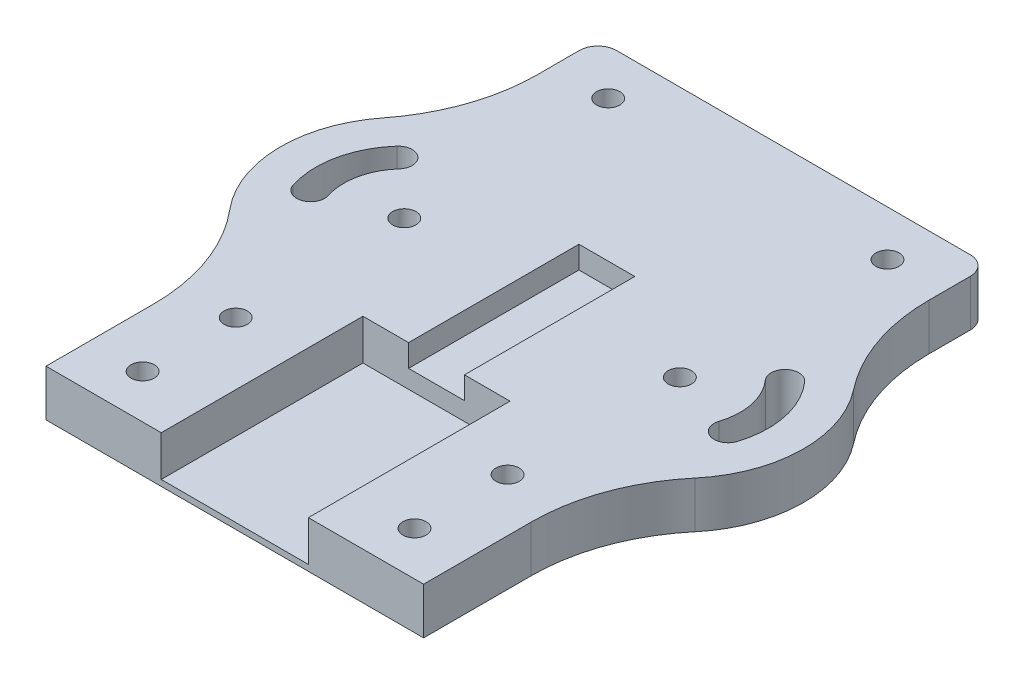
ISO-10303-21;
HEADER;
FILE_DESCRIPTION(('STEP AP214'),'2;1');
FILE_NAME('part.step','',(''),(''),'','','');
FILE_SCHEMA(('AUTOMOTIVE_DESIGN { 1 0 10303 214 1 1 1 1 }'));
ENDSEC;
DATA;
#1=APPLICATION_CONTEXT('core data for automotive mechanical design processes');
#2=APPLICATION_PROTOCOL_DEFINITION('international standard','automotive_design',2000,#1);
#3=PRODUCT_CONTEXT('',#1,'mechanical');
#4=PRODUCT('Part','Part','',(#3));
#5=PRODUCT_RELATED_PRODUCT_CATEGORY('part','',(#4));
#6=PRODUCT_DEFINITION_FORMATION('','',#4);
#7=PRODUCT_DEFINITION_CONTEXT('part definition',#1,'design');
#8=PRODUCT_DEFINITION('design','',#6,#7);
#9=PRODUCT_DEFINITION_SHAPE('','',#8);
#10=(LENGTH_UNIT() NAMED_UNIT(*) SI_UNIT(.MILLI.,.METRE.));
#11=(NAMED_UNIT(*) PLANE_ANGLE_UNIT() SI_UNIT($,.RADIAN.));
#12=(NAMED_UNIT(*) SI_UNIT($,.STERADIAN.) SOLID_ANGLE_UNIT());
#13=UNCERTAINTY_MEASURE_WITH_UNIT(LENGTH_MEASURE(1.E-05),#10,'distance_accuracy_value','');
#14=(GEOMETRIC_REPRESENTATION_CONTEXT(3) GLOBAL_UNCERTAINTY_ASSIGNED_CONTEXT((#13)) GLOBAL_UNIT_ASSIGNED_CONTEXT((#10,
#11,#12)) REPRESENTATION_CONTEXT('',''));
#15=CARTESIAN_POINT('',(0.,0.,0.));
#16=DIRECTION('',(0.,0.,1.));
#17=DIRECTION('',(1.,0.,0.));
#18=AXIS2_PLACEMENT_3D('',#15,#16,#17);
#19=CARTESIAN_POINT('',(24.1300000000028,6.35,-35.5600000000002));
#20=DIRECTION('',(0.,-1.,0.));
#21=DIRECTION('',(0.,0.,-1.));
#22=AXIS2_PLACEMENT_3D('',#19,#20,#21);
#23=CYLINDRICAL_SURFACE('',#22,2.54);
#24=CARTESIAN_POINT('',(24.1300000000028,0.,-35.5600000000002));
#25=DIRECTION('',(0.,1.,0.));
#26=DIRECTION('',(0.,0.,-1.));
#27=AXIS2_PLACEMENT_3D('',#24,#25,#26);
#28=CIRCLE('',#27,2.54);
#29=CARTESIAN_POINT('',(26.6700000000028,0.,-35.5600000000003));
#30=VERTEX_POINT('',#29);
#31=CARTESIAN_POINT('',(24.1300000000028,0.,-38.1000000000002));
#32=VERTEX_POINT('',#31);
#33=EDGE_CURVE('E401',#30,#32,#28,.T.);
#34=ORIENTED_EDGE('',*,*,#33,.T.);
#35=DIRECTION('',(0.,-1.,0.));
#36=VECTOR('',#35,1.);
#37=CARTESIAN_POINT('',(24.1300000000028,6.35,-38.1000000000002));
#38=LINE('',#37,#36);
#39=CARTESIAN_POINT('',(24.1300000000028,6.35,-38.1000000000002));
#40=VERTEX_POINT('',#39);
#41=EDGE_CURVE('E11',#40,#32,#38,.T.);
#42=ORIENTED_EDGE('',*,*,#41,.F.);
#43=CARTESIAN_POINT('',(24.1300000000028,6.35,-35.5600000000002));
#44=DIRECTION('',(0.,1.,0.));
#45=DIRECTION('',(0.,0.,-1.));
#46=AXIS2_PLACEMENT_3D('',#43,#44,#45);
#47=CIRCLE('',#46,2.54);
#48=CARTESIAN_POINT('',(26.6700000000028,6.35,-35.5600000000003));
#49=VERTEX_POINT('',#48);
#50=EDGE_CURVE('E404',#49,#40,#47,.T.);
#51=ORIENTED_EDGE('',*,*,#50,.F.);
#52=DIRECTION('',(0.,-1.,0.));
#53=VECTOR('',#52,1.);
#54=CARTESIAN_POINT('',(26.6700000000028,6.35,-35.5600000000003));
#55=LINE('',#54,#53);
#56=EDGE_CURVE('E436',#49,#30,#55,.T.);
#57=ORIENTED_EDGE('',*,*,#56,.T.);
#58=EDGE_LOOP('',(#34,#42,#51,#57));
#59=FACE_BOUND('',#58,.T.);
#60=ADVANCED_FACE('F30',(#59),#23,.T.);
#61=CARTESIAN_POINT('',(-24.1300000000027,6.35,-38.1000000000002));
#62=DIRECTION('',(0.,0.,1.));
#63=DIRECTION('',(1.,0.,0.));
#64=AXIS2_PLACEMENT_3D('',#61,#62,#63);
#65=PLANE('',#64);
#66=DIRECTION('',(-1.,0.,0.));
#67=VECTOR('',#66,1.);
#68=CARTESIAN_POINT('',(-24.1300000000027,0.,-38.1000000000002));
#69=LINE('',#68,#67);
#70=CARTESIAN_POINT('',(-24.1300000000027,0.,-38.1000000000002));
#71=VERTEX_POINT('',#70);
#72=EDGE_CURVE('E439',#32,#71,#69,.T.);
#73=ORIENTED_EDGE('',*,*,#72,.T.);
#74=DIRECTION('',(0.,-1.,0.));
#75=VECTOR('',#74,1.);
#76=CARTESIAN_POINT('',(-24.1300000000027,6.35,-38.1000000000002));
#77=LINE('',#76,#75);
#78=CARTESIAN_POINT('',(-24.1300000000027,6.35,-38.1000000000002));
#79=VERTEX_POINT('',#78);
#80=EDGE_CURVE('E37',#79,#71,#77,.T.);
#81=ORIENTED_EDGE('',*,*,#80,.F.);
#82=DIRECTION('',(-1.,0.,0.));
#83=VECTOR('',#82,1.);
#84=CARTESIAN_POINT('',(-24.1300000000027,6.35,-38.1000000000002));
#85=LINE('',#84,#83);
#86=EDGE_CURVE('E407',#40,#79,#85,.T.);
#87=ORIENTED_EDGE('',*,*,#86,.F.);
#88=ORIENTED_EDGE('',*,*,#41,.T.);
#89=EDGE_LOOP('',(#73,#81,#87,#88));
#90=FACE_BOUND('',#89,.T.);
#91=ADVANCED_FACE('F527',(#90),#65,.F.);
#92=CARTESIAN_POINT('',(-24.1300000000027,6.35,-35.5600000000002));
#93=DIRECTION('',(0.,-1.,0.));
#94=DIRECTION('',(0.,0.,-1.));
#95=AXIS2_PLACEMENT_3D('',#92,#93,#94);
#96=CYLINDRICAL_SURFACE('',#95,2.54);
#97=CARTESIAN_POINT('',(-24.1300000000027,0.,-35.5600000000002));
#98=DIRECTION('',(0.,1.,0.));
#99=DIRECTION('',(0.,0.,1.));
#100=AXIS2_PLACEMENT_3D('',#97,#98,#99);
#101=CIRCLE('',#100,2.54);
#102=CARTESIAN_POINT('',(-26.6700000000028,0.,-35.5600000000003));
#103=VERTEX_POINT('',#102);
#104=EDGE_CURVE('E441',#71,#103,#101,.T.);
#105=ORIENTED_EDGE('',*,*,#104,.T.);
#106=DIRECTION('',(0.,-1.,0.));
#107=VECTOR('',#106,1.);
#108=CARTESIAN_POINT('',(-26.6700000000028,6.35,-35.5600000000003));
#109=LINE('',#108,#107);
#110=CARTESIAN_POINT('',(-26.6700000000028,6.35,-35.5600000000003));
#111=VERTEX_POINT('',#110);
#112=EDGE_CURVE('E496',#111,#103,#109,.T.);
#113=ORIENTED_EDGE('',*,*,#112,.F.);
#114=CARTESIAN_POINT('',(-24.1300000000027,6.35,-35.5600000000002));
#115=DIRECTION('',(0.,1.,0.));
#116=DIRECTION('',(0.,0.,1.));
#117=AXIS2_PLACEMENT_3D('',#114,#115,#116);
#118=CIRCLE('',#117,2.54);
#119=EDGE_CURVE('E410',#79,#111,#118,.T.);
#120=ORIENTED_EDGE('',*,*,#119,.F.);
#121=ORIENTED_EDGE('',*,*,#80,.T.);
#122=EDGE_LOOP('',(#105,#113,#120,#121));
#123=FACE_BOUND('',#122,.T.);
#124=ADVANCED_FACE('F503',(#123),#96,.T.);
#125=CARTESIAN_POINT('',(-26.6700000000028,6.35,-29.9071743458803));
#126=DIRECTION('',(1.,0.,0.));
#127=DIRECTION('',(0.,0.,-1.));
#128=AXIS2_PLACEMENT_3D('',#125,#126,#127);
#129=PLANE('',#128);
#130=DIRECTION('',(0.,0.,1.));
#131=VECTOR('',#130,1.);
#132=CARTESIAN_POINT('',(-26.6700000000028,0.,-29.9071743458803));
#133=LINE('',#132,#131);
#134=CARTESIAN_POINT('',(-26.6700000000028,0.,-29.9071743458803));
#135=VERTEX_POINT('',#134);
#136=EDGE_CURVE('E443',#103,#135,#133,.T.);
#137=ORIENTED_EDGE('',*,*,#136,.T.);
#138=DIRECTION('',(0.,-1.,0.));
#139=VECTOR('',#138,1.);
#140=CARTESIAN_POINT('',(-26.6700000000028,6.35,-29.9071743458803));
#141=LINE('',#140,#139);
#142=CARTESIAN_POINT('',(-26.6700000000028,6.35,-29.9071743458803));
#143=VERTEX_POINT('',#142);
#144=EDGE_CURVE('E493',#143,#135,#141,.T.);
#145=ORIENTED_EDGE('',*,*,#144,.F.);
#146=DIRECTION('',(0.,0.,1.));
#147=VECTOR('',#146,1.);
#148=CARTESIAN_POINT('',(-26.6700000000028,6.35,-29.9071743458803));
#149=LINE('',#148,#147);
#150=EDGE_CURVE('E412',#111,#143,#149,.T.);
#151=ORIENTED_EDGE('',*,*,#150,.F.);
#152=ORIENTED_EDGE('',*,*,#112,.T.);
#153=EDGE_LOOP('',(#137,#145,#151,#152));
#154=FACE_BOUND('',#153,.T.);
#155=ADVANCED_FACE('F514',(#154),#129,.F.);
#156=CARTESIAN_POINT('',(-52.0700000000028,6.35,-29.9071743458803));
#157=DIRECTION('',(0.,-1.,0.));
#158=DIRECTION('',(0.,0.,-1.));
#159=AXIS2_PLACEMENT_3D('',#156,#157,#158);
#160=CYLINDRICAL_SURFACE('',#159,25.4);
#161=CARTESIAN_POINT('',(-52.0700000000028,0.,-29.9071743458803));
#162=DIRECTION('',(0.,-1.,0.));
#163=DIRECTION('',(0.,0.,-1.));
#164=AXIS2_PLACEMENT_3D('',#161,#162,#163);
#165=CIRCLE('',#164,25.4);
#166=CARTESIAN_POINT('',(-32.0838997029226,0.,-14.2318499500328));
#167=VERTEX_POINT('',#166);
#168=EDGE_CURVE('E445',#135,#167,#165,.T.);
#169=ORIENTED_EDGE('',*,*,#168,.T.);
#170=DIRECTION('',(0.,-1.,0.));
#171=VECTOR('',#170,1.);
#172=CARTESIAN_POINT('',(-32.0838997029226,6.35,-14.2318499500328));
#173=LINE('',#172,#171);
#174=CARTESIAN_POINT('',(-32.0838997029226,6.35,-14.2318499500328));
#175=VERTEX_POINT('',#174);
#176=EDGE_CURVE('E490',#175,#167,#173,.T.);
#177=ORIENTED_EDGE('',*,*,#176,.F.);
#178=CARTESIAN_POINT('',(-52.0700000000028,6.35,-29.9071743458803));
#179=DIRECTION('',(0.,-1.,0.));
#180=DIRECTION('',(0.,0.,-1.));
#181=AXIS2_PLACEMENT_3D('',#178,#179,#180);
#182=CIRCLE('',#181,25.4);
#183=EDGE_CURVE('E414',#143,#175,#182,.T.);
#184=ORIENTED_EDGE('',*,*,#183,.F.);
#185=ORIENTED_EDGE('',*,*,#144,.T.);
#186=EDGE_LOOP('',(#169,#177,#184,#185));
#187=FACE_BOUND('',#186,.T.);
#188=ADVANCED_FACE('F518',(#187),#160,.F.);
#189=CARTESIAN_POINT('',(-18.7960000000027,6.35,-3.80999999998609));
#190=DIRECTION('',(0.,-1.,0.));
#191=DIRECTION('',(0.,0.,-1.));
#192=AXIS2_PLACEMENT_3D('',#189,#190,#191);
#193=CYLINDRICAL_SURFACE('',#192,16.887369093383);
#194=CARTESIAN_POINT('',(-18.7960000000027,0.,-3.80999999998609));
#195=DIRECTION('',(0.,1.,0.));
#196=DIRECTION('',(0.,0.,-1.));
#197=AXIS2_PLACEMENT_3D('',#194,#195,#196);
#198=CIRCLE('',#197,16.887369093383);
#199=CARTESIAN_POINT('',(-31.7176442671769,0.,7.06264201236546));
#200=VERTEX_POINT('',#199);
#201=EDGE_CURVE('E447',#167,#200,#198,.T.);
#202=ORIENTED_EDGE('',*,*,#201,.T.);
#203=DIRECTION('',(0.,-1.,0.));
#204=VECTOR('',#203,1.);
#205=CARTESIAN_POINT('',(-31.7176442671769,6.35,7.06264201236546));
#206=LINE('',#205,#204);
#207=CARTESIAN_POINT('',(-31.7176442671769,6.35,7.06264201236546));
#208=VERTEX_POINT('',#207);
#209=EDGE_CURVE('E487',#208,#200,#206,.T.);
#210=ORIENTED_EDGE('',*,*,#209,.F.);
#211=CARTESIAN_POINT('',(-18.7960000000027,6.35,-3.80999999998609));
#212=DIRECTION('',(0.,1.,0.));
#213=DIRECTION('',(0.,0.,-1.));
#214=AXIS2_PLACEMENT_3D('',#211,#212,#213);
#215=CIRCLE('',#214,16.887369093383);
#216=EDGE_CURVE('E416',#175,#208,#215,.T.);
#217=ORIENTED_EDGE('',*,*,#216,.F.);
#218=ORIENTED_EDGE('',*,*,#176,.T.);
#219=EDGE_LOOP('',(#202,#210,#217,#218));
#220=FACE_BOUND('',#219,.T.);
#221=ADVANCED_FACE('F572',(#220),#193,.T.);
#222=CARTESIAN_POINT('',(-51.152866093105,6.35,23.4159949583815));
#223=DIRECTION('',(0.,-1.,0.));
#224=DIRECTION('',(0.,0.,-1.));
#225=AXIS2_PLACEMENT_3D('',#222,#223,#224);
#226=CYLINDRICAL_SURFACE('',#225,25.4);
#227=CARTESIAN_POINT('',(-51.152866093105,0.,23.4159949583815));
#228=DIRECTION('',(0.,-1.,0.));
#229=DIRECTION('',(0.,0.,-1.));
#230=AXIS2_PLACEMENT_3D('',#227,#228,#229);
#231=CIRCLE('',#230,25.4);
#232=CARTESIAN_POINT('',(-25.752866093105,0.,23.4159949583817));
#233=VERTEX_POINT('',#232);
#234=EDGE_CURVE('E449',#200,#233,#231,.T.);
#235=ORIENTED_EDGE('',*,*,#234,.T.);
#236=DIRECTION('',(0.,-1.,0.));
#237=VECTOR('',#236,1.);
#238=CARTESIAN_POINT('',(-25.752866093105,6.35,23.4159949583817));
#239=LINE('',#238,#237);
#240=CARTESIAN_POINT('',(-25.752866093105,6.35,23.4159949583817));
#241=VERTEX_POINT('',#240);
#242=EDGE_CURVE('E484',#241,#233,#239,.T.);
#243=ORIENTED_EDGE('',*,*,#242,.F.);
#244=CARTESIAN_POINT('',(-51.152866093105,6.35,23.4159949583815));
#245=DIRECTION('',(0.,-1.,0.));
#246=DIRECTION('',(0.,0.,-1.));
#247=AXIS2_PLACEMENT_3D('',#244,#245,#246);
#248=CIRCLE('',#247,25.4);
#249=EDGE_CURVE('E418',#208,#241,#248,.T.);
#250=ORIENTED_EDGE('',*,*,#249,.F.);
#251=ORIENTED_EDGE('',*,*,#209,.T.);
#252=EDGE_LOOP('',(#235,#243,#250,#251));
#253=FACE_BOUND('',#252,.T.);
#254=ADVANCED_FACE('F570',(#253),#226,.F.);
#255=CARTESIAN_POINT('',(-25.7528660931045,6.35,38.0999999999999));
#256=DIRECTION('',(1.,0.,0.));
#257=DIRECTION('',(0.,0.,-1.));
#258=AXIS2_PLACEMENT_3D('',#255,#256,#257);
#259=PLANE('',#258);
#260=DIRECTION('',(0.,0.,1.));
#261=VECTOR('',#260,1.);
#262=CARTESIAN_POINT('',(-25.7528660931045,0.,38.0999999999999));
#263=LINE('',#262,#261);
#264=CARTESIAN_POINT('',(-25.7528660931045,0.,38.0999999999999));
#265=VERTEX_POINT('',#264);
#266=EDGE_CURVE('E451',#233,#265,#263,.T.);
#267=ORIENTED_EDGE('',*,*,#266,.T.);
#268=DIRECTION('',(0.,-1.,0.));
#269=VECTOR('',#268,1.);
#270=CARTESIAN_POINT('',(-25.7528660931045,6.35,38.0999999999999));
#271=LINE('',#270,#269);
#272=CARTESIAN_POINT('',(-25.7528660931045,6.35,38.0999999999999));
#273=VERTEX_POINT('',#272);
#274=EDGE_CURVE('E481',#273,#265,#271,.T.);
#275=ORIENTED_EDGE('',*,*,#274,.F.);
#276=DIRECTION('',(0.,0.,1.));
#277=VECTOR('',#276,1.);
#278=CARTESIAN_POINT('',(-25.7528660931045,6.35,38.0999999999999));
#279=LINE('',#278,#277);
#280=EDGE_CURVE('E420',#241,#273,#279,.T.);
#281=ORIENTED_EDGE('',*,*,#280,.F.);
#282=ORIENTED_EDGE('',*,*,#242,.T.);
#283=EDGE_LOOP('',(#267,#275,#281,#282));
#284=FACE_BOUND('',#283,.T.);
#285=ADVANCED_FACE('F565',(#284),#259,.F.);
#286=CARTESIAN_POINT('',(-25.7528660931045,6.35,38.0999999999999));
#287=DIRECTION('',(0.,0.,-1.));
#288=DIRECTION('',(-1.,0.,0.));
#289=AXIS2_PLACEMENT_3D('',#286,#287,#288);
#290=PLANE('',#289);
#291=DIRECTION('',(1.,0.,0.));
#292=VECTOR('',#291,1.);
#293=CARTESIAN_POINT('',(-25.7528660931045,6.35,38.0999999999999));
#294=LINE('',#293,#292);
#295=CARTESIAN_POINT('',(10.033,6.35,38.0999999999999));
#296=VERTEX_POINT('',#295);
#297=CARTESIAN_POINT('',(25.7528660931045,6.35,38.0999999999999));
#298=VERTEX_POINT('',#297);
#299=EDGE_CURVE('E422',#296,#298,#294,.T.);
#300=ORIENTED_EDGE('',*,*,#299,.F.);
#301=DIRECTION('',(0.,1.,0.));
#302=VECTOR('',#301,1.);
#303=CARTESIAN_POINT('',(10.033,0.8255,38.0999999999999));
#304=LINE('',#303,#302);
#305=CARTESIAN_POINT('',(10.033,0.8255,38.0999999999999));
#306=VERTEX_POINT('',#305);
#307=EDGE_CURVE('E282',#306,#296,#304,.T.);
#308=ORIENTED_EDGE('',*,*,#307,.F.);
#309=DIRECTION('',(1.,0.,0.));
#310=VECTOR('',#309,1.);
#311=CARTESIAN_POINT('',(-81.3466493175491,0.8255,38.0999999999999));
#312=LINE('',#311,#310);
#313=CARTESIAN_POINT('',(-10.033,0.8255,38.0999999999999));
#314=VERTEX_POINT('',#313);
#315=EDGE_CURVE('E271',#314,#306,#312,.T.);
#316=ORIENTED_EDGE('',*,*,#315,.F.);
#317=DIRECTION('',(0.,1.,0.));
#318=VECTOR('',#317,1.);
#319=CARTESIAN_POINT('',(-10.033,0.8255,38.0999999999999));
#320=LINE('',#319,#318);
#321=CARTESIAN_POINT('',(-10.033,6.35,38.0999999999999));
#322=VERTEX_POINT('',#321);
#323=EDGE_CURVE('E285',#314,#322,#320,.T.);
#324=ORIENTED_EDGE('',*,*,#323,.T.);
#325=EDGE_CURVE('E423',#273,#322,#294,.T.);
#326=ORIENTED_EDGE('',*,*,#325,.F.);
#327=ORIENTED_EDGE('',*,*,#274,.T.);
#328=DIRECTION('',(1.,0.,0.));
#329=VECTOR('',#328,1.);
#330=CARTESIAN_POINT('',(-25.7528660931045,0.,38.0999999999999));
#331=LINE('',#330,#329);
#332=CARTESIAN_POINT('',(25.7528660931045,0.,38.0999999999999));
#333=VERTEX_POINT('',#332);
#334=EDGE_CURVE('E453',#265,#333,#331,.T.);
#335=ORIENTED_EDGE('',*,*,#334,.T.);
#336=DIRECTION('',(0.,-1.,0.));
#337=VECTOR('',#336,1.);
#338=CARTESIAN_POINT('',(25.7528660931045,6.35,38.0999999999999));
#339=LINE('',#338,#337);
#340=EDGE_CURVE('E478',#298,#333,#339,.T.);
#341=ORIENTED_EDGE('',*,*,#340,.F.);
#342=EDGE_LOOP('',(#300,#308,#316,#324,#326,#327,#335,#341));
#343=FACE_BOUND('',#342,.T.);
#344=ADVANCED_FACE('F558',(#343),#290,.F.);
#345=CARTESIAN_POINT('',(25.7528660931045,6.35,38.0999999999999));
#346=DIRECTION('',(-1.,0.,0.));
#347=DIRECTION('',(0.,0.,1.));
#348=AXIS2_PLACEMENT_3D('',#345,#346,#347);
#349=PLANE('',#348);
#350=DIRECTION('',(0.,0.,-1.));
#351=VECTOR('',#350,1.);
#352=CARTESIAN_POINT('',(25.7528660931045,0.,38.0999999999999));
#353=LINE('',#352,#351);
#354=CARTESIAN_POINT('',(25.7528660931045,0.,23.415994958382));
#355=VERTEX_POINT('',#354);
#356=EDGE_CURVE('E455',#333,#355,#353,.T.);
#357=ORIENTED_EDGE('',*,*,#356,.T.);
#358=DIRECTION('',(0.,-1.,0.));
#359=VECTOR('',#358,1.);
#360=CARTESIAN_POINT('',(25.7528660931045,6.35,23.415994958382));
#361=LINE('',#360,#359);
#362=CARTESIAN_POINT('',(25.7528660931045,6.35,23.415994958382));
#363=VERTEX_POINT('',#362);
#364=EDGE_CURVE('E475',#363,#355,#361,.T.);
#365=ORIENTED_EDGE('',*,*,#364,.F.);
#366=DIRECTION('',(0.,0.,-1.));
#367=VECTOR('',#366,1.);
#368=CARTESIAN_POINT('',(25.7528660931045,6.35,38.0999999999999));
#369=LINE('',#368,#367);
#370=EDGE_CURVE('E426',#298,#363,#369,.T.);
#371=ORIENTED_EDGE('',*,*,#370,.F.);
#372=ORIENTED_EDGE('',*,*,#340,.T.);
#373=EDGE_LOOP('',(#357,#365,#371,#372));
#374=FACE_BOUND('',#373,.T.);
#375=ADVANCED_FACE('F554',(#374),#349,.F.);
#376=CARTESIAN_POINT('',(51.1528660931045,6.35,23.415994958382));
#377=DIRECTION('',(0.,-1.,0.));
#378=DIRECTION('',(0.,0.,-1.));
#379=AXIS2_PLACEMENT_3D('',#376,#377,#378);
#380=CYLINDRICAL_SURFACE('',#379,25.4);
#381=CARTESIAN_POINT('',(51.1528660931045,0.,23.415994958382));
#382=DIRECTION('',(0.,-1.,0.));
#383=DIRECTION('',(0.,0.,1.));
#384=AXIS2_PLACEMENT_3D('',#381,#382,#383);
#385=CIRCLE('',#384,25.4);
#386=CARTESIAN_POINT('',(31.7176442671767,0.,7.06264201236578));
#387=VERTEX_POINT('',#386);
#388=EDGE_CURVE('E457',#355,#387,#385,.T.);
#389=ORIENTED_EDGE('',*,*,#388,.T.);
#390=DIRECTION('',(0.,-1.,0.));
#391=VECTOR('',#390,1.);
#392=CARTESIAN_POINT('',(31.7176442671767,6.35,7.06264201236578));
#393=LINE('',#392,#391);
#394=CARTESIAN_POINT('',(31.7176442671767,6.35,7.06264201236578));
#395=VERTEX_POINT('',#394);
#396=EDGE_CURVE('E472',#395,#387,#393,.T.);
#397=ORIENTED_EDGE('',*,*,#396,.F.);
#398=CARTESIAN_POINT('',(51.1528660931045,6.35,23.415994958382));
#399=DIRECTION('',(0.,-1.,0.));
#400=DIRECTION('',(0.,0.,1.));
#401=AXIS2_PLACEMENT_3D('',#398,#399,#400);
#402=CIRCLE('',#401,25.4);
#403=EDGE_CURVE('E428',#363,#395,#402,.T.);
#404=ORIENTED_EDGE('',*,*,#403,.F.);
#405=ORIENTED_EDGE('',*,*,#364,.T.);
#406=EDGE_LOOP('',(#389,#397,#404,#405));
#407=FACE_BOUND('',#406,.T.);
#408=ADVANCED_FACE('F549',(#407),#380,.F.);
#409=CARTESIAN_POINT('',(18.7960000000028,6.35,-3.80999999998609));
#410=DIRECTION('',(0.,-1.,0.));
#411=DIRECTION('',(0.,0.,-1.));
#412=AXIS2_PLACEMENT_3D('',#409,#410,#411);
#413=CYLINDRICAL_SURFACE('',#412,16.887369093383);
#414=CARTESIAN_POINT('',(18.7960000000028,0.,-3.80999999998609));
#415=DIRECTION('',(0.,1.,0.));
#416=DIRECTION('',(0.,0.,1.));
#417=AXIS2_PLACEMENT_3D('',#414,#415,#416);
#418=CIRCLE('',#417,16.887369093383);
#419=CARTESIAN_POINT('',(32.0838997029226,0.,-14.2318499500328));
#420=VERTEX_POINT('',#419);
#421=EDGE_CURVE('E459',#387,#420,#418,.T.);
#422=ORIENTED_EDGE('',*,*,#421,.T.);
#423=DIRECTION('',(0.,-1.,0.));
#424=VECTOR('',#423,1.);
#425=CARTESIAN_POINT('',(32.0838997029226,6.35,-14.2318499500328));
#426=LINE('',#425,#424);
#427=CARTESIAN_POINT('',(32.0838997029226,6.35,-14.2318499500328));
#428=VERTEX_POINT('',#427);
#429=EDGE_CURVE('E469',#428,#420,#426,.T.);
#430=ORIENTED_EDGE('',*,*,#429,.F.);
#431=CARTESIAN_POINT('',(18.7960000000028,6.35,-3.80999999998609));
#432=DIRECTION('',(0.,1.,0.));
#433=DIRECTION('',(0.,0.,1.));
#434=AXIS2_PLACEMENT_3D('',#431,#432,#433);
#435=CIRCLE('',#434,16.887369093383);
#436=EDGE_CURVE('E430',#395,#428,#435,.T.);
#437=ORIENTED_EDGE('',*,*,#436,.F.);
#438=ORIENTED_EDGE('',*,*,#396,.T.);
#439=EDGE_LOOP('',(#422,#430,#437,#438));
#440=FACE_BOUND('',#439,.T.);
#441=ADVANCED_FACE('F543',(#440),#413,.T.);
#442=CARTESIAN_POINT('',(52.0700000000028,6.35,-29.9071743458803));
#443=DIRECTION('',(0.,-1.,0.));
#444=DIRECTION('',(0.,0.,-1.));
#445=AXIS2_PLACEMENT_3D('',#442,#443,#444);
#446=CYLINDRICAL_SURFACE('',#445,25.4);
#447=CARTESIAN_POINT('',(52.0700000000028,0.,-29.9071743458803));
#448=DIRECTION('',(0.,-1.,0.));
#449=DIRECTION('',(0.,0.,1.));
#450=AXIS2_PLACEMENT_3D('',#447,#448,#449);
#451=CIRCLE('',#450,25.4);
#452=CARTESIAN_POINT('',(26.6700000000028,0.,-29.9071743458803));
#453=VERTEX_POINT('',#452);
#454=EDGE_CURVE('E461',#420,#453,#451,.T.);
#455=ORIENTED_EDGE('',*,*,#454,.T.);
#456=DIRECTION('',(0.,-1.,0.));
#457=VECTOR('',#456,1.);
#458=CARTESIAN_POINT('',(26.6700000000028,6.35,-29.9071743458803));
#459=LINE('',#458,#457);
#460=CARTESIAN_POINT('',(26.6700000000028,6.35,-29.9071743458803));
#461=VERTEX_POINT('',#460);
#462=EDGE_CURVE('E466',#461,#453,#459,.T.);
#463=ORIENTED_EDGE('',*,*,#462,.F.);
#464=CARTESIAN_POINT('',(52.0700000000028,6.35,-29.9071743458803));
#465=DIRECTION('',(0.,-1.,0.));
#466=DIRECTION('',(0.,0.,1.));
#467=AXIS2_PLACEMENT_3D('',#464,#465,#466);
#468=CIRCLE('',#467,25.4);
#469=EDGE_CURVE('E432',#428,#461,#468,.T.);
#470=ORIENTED_EDGE('',*,*,#469,.F.);
#471=ORIENTED_EDGE('',*,*,#429,.T.);
#472=EDGE_LOOP('',(#455,#463,#470,#471));
#473=FACE_BOUND('',#472,.T.);
#474=ADVANCED_FACE('F539',(#473),#446,.F.);
#475=CARTESIAN_POINT('',(26.6700000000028,6.35,-29.9071743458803));
#476=DIRECTION('',(-1.,0.,0.));
#477=DIRECTION('',(0.,0.,1.));
#478=AXIS2_PLACEMENT_3D('',#475,#476,#477);
#479=PLANE('',#478);
#480=DIRECTION('',(0.,0.,-1.));
#481=VECTOR('',#480,1.);
#482=CARTESIAN_POINT('',(26.6700000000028,0.,-29.9071743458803));
#483=LINE('',#482,#481);
#484=EDGE_CURVE('E408',#453,#30,#483,.T.);
#485=ORIENTED_EDGE('',*,*,#484,.T.);
#486=ORIENTED_EDGE('',*,*,#56,.F.);
#487=DIRECTION('',(0.,0.,-1.));
#488=VECTOR('',#487,1.);
#489=CARTESIAN_POINT('',(26.6700000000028,6.35,-29.9071743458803));
#490=LINE('',#489,#488);
#491=EDGE_CURVE('E434',#461,#49,#490,.T.);
#492=ORIENTED_EDGE('',*,*,#491,.F.);
#493=ORIENTED_EDGE('',*,*,#462,.T.);
#494=EDGE_LOOP('',(#485,#486,#492,#493));
#495=FACE_BOUND('',#494,.T.);
#496=ADVANCED_FACE('F534',(#495),#479,.F.);
#497=CARTESIAN_POINT('',(24.1300000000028,6.35,-35.5600000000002));
#498=DIRECTION('',(0.,-1.,0.));
#499=DIRECTION('',(0.,0.,-1.));
#500=AXIS2_PLACEMENT_3D('',#497,#498,#499);
#501=PLANE('',#500);
#502=DIRECTION('',(-1.,0.,0.));
#503=VECTOR('',#502,1.);
#504=CARTESIAN_POINT('',(-81.3466493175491,6.35,-12.6522422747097));
#505=LINE('',#504,#503);
#506=CARTESIAN_POINT('',(3.80999999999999,6.35,-12.6522422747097));
#507=VERTEX_POINT('',#506);
#508=CARTESIAN_POINT('',(-3.80999999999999,6.35,-12.6522422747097));
#509=VERTEX_POINT('',#508);
#510=EDGE_CURVE('E249',#507,#509,#505,.T.);
#511=ORIENTED_EDGE('',*,*,#510,.F.);
#512=DIRECTION('',(0.,0.,-1.));
#513=VECTOR('',#512,1.);
#514=CARTESIAN_POINT('',(3.80999999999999,6.35,-1.77218197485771E-13));
#515=LINE('',#514,#513);
#516=CARTESIAN_POINT('',(3.80999999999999,6.35,10.5846664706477));
#517=VERTEX_POINT('',#516);
#518=EDGE_CURVE('E233',#517,#507,#515,.T.);
#519=ORIENTED_EDGE('',*,*,#518,.F.);
#520=DIRECTION('',(-1.,0.,0.));
#521=VECTOR('',#520,1.);
#522=CARTESIAN_POINT('',(-81.3466493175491,6.35,10.5846664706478));
#523=LINE('',#522,#521);
#524=CARTESIAN_POINT('',(10.033,6.35,10.5846664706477));
#525=VERTEX_POINT('',#524);
#526=EDGE_CURVE('E277',#525,#517,#523,.T.);
#527=ORIENTED_EDGE('',*,*,#526,.F.);
#528=DIRECTION('',(0.,0.,-1.));
#529=VECTOR('',#528,1.);
#530=CARTESIAN_POINT('',(10.033,6.35,-1.77218197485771E-13));
#531=LINE('',#530,#529);
#532=EDGE_CURVE('E52',#296,#525,#531,.T.);
#533=ORIENTED_EDGE('',*,*,#532,.F.);
#534=ORIENTED_EDGE('',*,*,#299,.T.);
#535=ORIENTED_EDGE('',*,*,#370,.T.);
#536=ORIENTED_EDGE('',*,*,#403,.T.);
#537=ORIENTED_EDGE('',*,*,#436,.T.);
#538=ORIENTED_EDGE('',*,*,#469,.T.);
#539=ORIENTED_EDGE('',*,*,#491,.T.);
#540=ORIENTED_EDGE('',*,*,#50,.T.);
#541=ORIENTED_EDGE('',*,*,#86,.T.);
#542=ORIENTED_EDGE('',*,*,#119,.T.);
#543=ORIENTED_EDGE('',*,*,#150,.T.);
#544=ORIENTED_EDGE('',*,*,#183,.T.);
#545=ORIENTED_EDGE('',*,*,#216,.T.);
#546=ORIENTED_EDGE('',*,*,#249,.T.);
#547=ORIENTED_EDGE('',*,*,#280,.T.);
#548=ORIENTED_EDGE('',*,*,#325,.T.);
#549=DIRECTION('',(0.,0.,-1.));
#550=VECTOR('',#549,1.);
#551=CARTESIAN_POINT('',(-10.033,6.35,-1.77218197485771E-13));
#552=LINE('',#551,#550);
#553=CARTESIAN_POINT('',(-10.033,6.35,10.5846664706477));
#554=VERTEX_POINT('',#553);
#555=EDGE_CURVE('E266',#322,#554,#552,.T.);
#556=ORIENTED_EDGE('',*,*,#555,.T.);
#557=CARTESIAN_POINT('',(-3.80999999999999,6.35,10.5846664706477));
#558=VERTEX_POINT('',#557);
#559=EDGE_CURVE('E276',#558,#554,#523,.T.);
#560=ORIENTED_EDGE('',*,*,#559,.F.);
#561=DIRECTION('',(0.,0.,-1.));
#562=VECTOR('',#561,1.);
#563=CARTESIAN_POINT('',(-3.80999999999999,6.35,-1.77218197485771E-13));
#564=LINE('',#563,#562);
#565=EDGE_CURVE('E246',#558,#509,#564,.T.);
#566=ORIENTED_EDGE('',*,*,#565,.T.);
#567=EDGE_LOOP('',(#511,#519,#527,#533,#534,#535,#536,#537,#538,#539,#540,#541,#542,#543,#544,
#545,#546,#547,#548,#556,#560,#566));
#568=FACE_BOUND('',#567,.T.);
#569=CARTESIAN_POINT('',(18.5431134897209,6.35,19.4335986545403));
#570=DIRECTION('',(0.,1.,0.));
#571=DIRECTION('',(0.,0.,-1.));
#572=AXIS2_PLACEMENT_3D('',#569,#570,#571);
#573=CIRCLE('',#572,1.5875);
#574=CARTESIAN_POINT('',(18.5431134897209,6.35,17.8460986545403));
#575=VERTEX_POINT('',#574);
#576=EDGE_CURVE('E284',#575,#575,#573,.T.);
#577=ORIENTED_EDGE('',*,*,#576,.F.);
#578=EDGE_LOOP('',(#577));
#579=FACE_BOUND('',#578,.T.);
#580=CARTESIAN_POINT('',(18.5431134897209,6.35,32.1335986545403));
#581=DIRECTION('',(0.,1.,0.));
#582=DIRECTION('',(0.,0.,-1.));
#583=AXIS2_PLACEMENT_3D('',#580,#581,#582);
#584=CIRCLE('',#583,1.5875);
#585=CARTESIAN_POINT('',(18.5431134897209,6.35,30.5460986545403));
#586=VERTEX_POINT('',#585);
#587=EDGE_CURVE('E295',#586,#586,#584,.T.);
#588=ORIENTED_EDGE('',*,*,#587,.F.);
#589=EDGE_LOOP('',(#588));
#590=FACE_BOUND('',#589,.T.);
#591=CARTESIAN_POINT('',(-18.5431134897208,6.35,32.1335986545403));
#592=DIRECTION('',(0.,1.,0.));
#593=DIRECTION('',(0.,0.,1.));
#594=AXIS2_PLACEMENT_3D('',#591,#592,#593);
#595=CIRCLE('',#594,1.5875);
#596=CARTESIAN_POINT('',(-18.5431134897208,6.35,33.7210986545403));
#597=VERTEX_POINT('',#596);
#598=EDGE_CURVE('E301',#597,#597,#595,.T.);
#599=ORIENTED_EDGE('',*,*,#598,.F.);
#600=EDGE_LOOP('',(#599));
#601=FACE_BOUND('',#600,.T.);
#602=CARTESIAN_POINT('',(-18.5431134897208,6.35,19.4335986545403));
#603=DIRECTION('',(0.,1.,0.));
#604=DIRECTION('',(0.,0.,1.));
#605=AXIS2_PLACEMENT_3D('',#602,#603,#604);
#606=CIRCLE('',#605,1.5875);
#607=CARTESIAN_POINT('',(-18.5431134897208,6.35,21.0210986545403));
#608=VERTEX_POINT('',#607);
#609=EDGE_CURVE('E307',#608,#608,#606,.T.);
#610=ORIENTED_EDGE('',*,*,#609,.F.);
#611=EDGE_LOOP('',(#610));
#612=FACE_BOUND('',#611,.T.);
#613=CARTESIAN_POINT('',(-26.382094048,6.35,-10.5684596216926));
#614=DIRECTION('',(0.,1.,0.));
#615=DIRECTION('',(0.,0.,-1.));
#616=AXIS2_PLACEMENT_3D('',#613,#614,#615);
#617=CIRCLE('',#616,1.905);
#618=CARTESIAN_POINT('',(-24.9597014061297,6.35,-9.30124844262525));
#619=VERTEX_POINT('',#618);
#620=CARTESIAN_POINT('',(-27.8044866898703,6.35,-11.83567080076));
#621=VERTEX_POINT('',#620);
#622=EDGE_CURVE('E331',#619,#621,#617,.T.);
#623=ORIENTED_EDGE('',*,*,#622,.F.);
#624=CARTESIAN_POINT('',(-18.7959999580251,6.35,-3.80999999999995));
#625=DIRECTION('',(0.,-1.,0.));
#626=DIRECTION('',(0.,0.,-1.));
#627=AXIS2_PLACEMENT_3D('',#624,#625,#626);
#628=CIRCLE('',#627,8.25500000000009);
#629=CARTESIAN_POINT('',(-26.6588991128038,6.35,-1.29607043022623));
#630=VERTEX_POINT('',#629);
#631=EDGE_CURVE('E313',#630,#619,#628,.T.);
#632=ORIENTED_EDGE('',*,*,#631,.F.);
#633=CARTESIAN_POINT('',(-28.4734143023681,6.35,-0.715932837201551));
#634=DIRECTION('',(0.,1.,0.));
#635=DIRECTION('',(0.,0.,-1.));
#636=AXIS2_PLACEMENT_3D('',#633,#634,#635);
#637=CIRCLE('',#636,1.905);
#638=CARTESIAN_POINT('',(-30.2879294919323,6.35,-0.135795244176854));
#639=VERTEX_POINT('',#638);
#640=EDGE_CURVE('E320',#639,#630,#637,.T.);
#641=ORIENTED_EDGE('',*,*,#640,.F.);
#642=CARTESIAN_POINT('',(-18.7959999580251,6.35,-3.80999999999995));
#643=DIRECTION('',(0.,1.,0.));
#644=DIRECTION('',(0.,0.,-1.));
#645=AXIS2_PLACEMENT_3D('',#642,#643,#644);
#646=CIRCLE('',#645,12.0650000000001);
#647=EDGE_CURVE('E334',#621,#639,#646,.T.);
#648=ORIENTED_EDGE('',*,*,#647,.F.);
#649=EDGE_LOOP('',(#623,#632,#641,#648));
#650=FACE_BOUND('',#649,.T.);
#651=CARTESIAN_POINT('',(26.382094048,6.35,-10.5684596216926));
#652=DIRECTION('',(0.,1.,0.));
#653=DIRECTION('',(0.,0.,1.));
#654=AXIS2_PLACEMENT_3D('',#651,#652,#653);
#655=CIRCLE('',#654,1.905);
#656=CARTESIAN_POINT('',(27.8044866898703,6.35,-11.83567080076));
#657=VERTEX_POINT('',#656);
#658=CARTESIAN_POINT('',(24.9597014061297,6.35,-9.30124844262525));
#659=VERTEX_POINT('',#658);
#660=EDGE_CURVE('E363',#657,#659,#655,.T.);
#661=ORIENTED_EDGE('',*,*,#660,.F.);
#662=CARTESIAN_POINT('',(18.7959999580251,6.35,-3.80999999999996));
#663=DIRECTION('',(0.,1.,0.));
#664=DIRECTION('',(0.,0.,1.));
#665=AXIS2_PLACEMENT_3D('',#662,#663,#664);
#666=CIRCLE('',#665,12.0650000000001);
#667=CARTESIAN_POINT('',(30.2879294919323,6.35,-0.135795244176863));
#668=VERTEX_POINT('',#667);
#669=EDGE_CURVE('E341',#668,#657,#666,.T.);
#670=ORIENTED_EDGE('',*,*,#669,.F.);
#671=CARTESIAN_POINT('',(28.4734143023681,6.35,-0.715932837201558));
#672=DIRECTION('',(0.,1.,0.));
#673=DIRECTION('',(0.,0.,1.));
#674=AXIS2_PLACEMENT_3D('',#671,#672,#673);
#675=CIRCLE('',#674,1.905);
#676=CARTESIAN_POINT('',(26.6588991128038,6.35,-1.29607043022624));
#677=VERTEX_POINT('',#676);
#678=EDGE_CURVE('E352',#677,#668,#675,.T.);
#679=ORIENTED_EDGE('',*,*,#678,.F.);
#680=CARTESIAN_POINT('',(18.7959999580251,6.35,-3.80999999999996));
#681=DIRECTION('',(0.,-1.,0.));
#682=DIRECTION('',(0.,0.,1.));
#683=AXIS2_PLACEMENT_3D('',#680,#681,#682);
#684=CIRCLE('',#683,8.25500000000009);
#685=EDGE_CURVE('E366',#659,#677,#684,.T.);
#686=ORIENTED_EDGE('',*,*,#685,.F.);
#687=EDGE_LOOP('',(#661,#670,#679,#686));
#688=FACE_BOUND('',#687,.T.);
#689=CARTESIAN_POINT('',(-19.05,6.35,-31.8782960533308));
#690=DIRECTION('',(0.,1.,0.));
#691=DIRECTION('',(0.,0.,-1.));
#692=AXIS2_PLACEMENT_3D('',#689,#690,#691);
#693=CIRCLE('',#692,1.5875);
#694=CARTESIAN_POINT('',(-19.05,6.35,-33.4657960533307));
#695=VERTEX_POINT('',#694);
#696=EDGE_CURVE('E373',#695,#695,#693,.T.);
#697=ORIENTED_EDGE('',*,*,#696,.F.);
#698=EDGE_LOOP('',(#697));
#699=FACE_BOUND('',#698,.T.);
#700=CARTESIAN_POINT('',(-18.796,6.35,-3.81000000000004));
#701=DIRECTION('',(0.,1.,0.));
#702=DIRECTION('',(0.,0.,1.));
#703=AXIS2_PLACEMENT_3D('',#700,#701,#702);
#704=CIRCLE('',#703,1.5875);
#705=CARTESIAN_POINT('',(-18.796,6.35,-2.22250000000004));
#706=VERTEX_POINT('',#705);
#707=EDGE_CURVE('E383',#706,#706,#704,.T.);
#708=ORIENTED_EDGE('',*,*,#707,.F.);
#709=EDGE_LOOP('',(#708));
#710=FACE_BOUND('',#709,.T.);
#711=CARTESIAN_POINT('',(18.796,6.35,-3.81000000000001));
#712=DIRECTION('',(0.,1.,0.));
#713=DIRECTION('',(0.,0.,-1.));
#714=AXIS2_PLACEMENT_3D('',#711,#712,#713);
#715=CIRCLE('',#714,1.5875);
#716=CARTESIAN_POINT('',(18.796,6.35,-5.39750000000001));
#717=VERTEX_POINT('',#716);
#718=EDGE_CURVE('E389',#717,#717,#715,.T.);
#719=ORIENTED_EDGE('',*,*,#718,.F.);
#720=EDGE_LOOP('',(#719));
#721=FACE_BOUND('',#720,.T.);
#722=CARTESIAN_POINT('',(19.05,6.35,-31.8782960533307));
#723=DIRECTION('',(0.,1.,0.));
#724=DIRECTION('',(0.,0.,1.));
#725=AXIS2_PLACEMENT_3D('',#722,#723,#724);
#726=CIRCLE('',#725,1.5875);
#727=CARTESIAN_POINT('',(19.05,6.35,-30.2907960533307));
#728=VERTEX_POINT('',#727);
#729=EDGE_CURVE('E395',#728,#728,#726,.T.);
#730=ORIENTED_EDGE('',*,*,#729,.F.);
#731=EDGE_LOOP('',(#730));
#732=FACE_BOUND('',#731,.T.);
#733=ADVANCED_FACE('F522',(#568,#579,#590,#601,#612,#650,#688,#699,#710,#721,#732),#501,.F.);
#734=CARTESIAN_POINT('',(24.1300000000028,0.,-35.5600000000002));
#735=DIRECTION('',(0.,-1.,0.));
#736=DIRECTION('',(0.,0.,-1.));
#737=AXIS2_PLACEMENT_3D('',#734,#735,#736);
#738=PLANE('',#737);
#739=CARTESIAN_POINT('',(18.5431134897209,0.,19.4335986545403));
#740=DIRECTION('',(0.,1.,0.));
#741=DIRECTION('',(0.,0.,-1.));
#742=AXIS2_PLACEMENT_3D('',#739,#740,#741);
#743=CIRCLE('',#742,1.5875);
#744=CARTESIAN_POINT('',(18.5431134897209,0.,17.8460986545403));
#745=VERTEX_POINT('',#744);
#746=EDGE_CURVE('E292',#745,#745,#743,.T.);
#747=ORIENTED_EDGE('',*,*,#746,.T.);
#748=EDGE_LOOP('',(#747));
#749=FACE_BOUND('',#748,.T.);
#750=CARTESIAN_POINT('',(18.5431134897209,0.,32.1335986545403));
#751=DIRECTION('',(0.,1.,0.));
#752=DIRECTION('',(0.,0.,-1.));
#753=AXIS2_PLACEMENT_3D('',#750,#751,#752);
#754=CIRCLE('',#753,1.5875);
#755=CARTESIAN_POINT('',(18.5431134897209,0.,30.5460986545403));
#756=VERTEX_POINT('',#755);
#757=EDGE_CURVE('E298',#756,#756,#754,.T.);
#758=ORIENTED_EDGE('',*,*,#757,.T.);
#759=EDGE_LOOP('',(#758));
#760=FACE_BOUND('',#759,.T.);
#761=CARTESIAN_POINT('',(-18.5431134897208,0.,32.1335986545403));
#762=DIRECTION('',(0.,1.,0.));
#763=DIRECTION('',(0.,0.,1.));
#764=AXIS2_PLACEMENT_3D('',#761,#762,#763);
#765=CIRCLE('',#764,1.5875);
#766=CARTESIAN_POINT('',(-18.5431134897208,0.,33.7210986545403));
#767=VERTEX_POINT('',#766);
#768=EDGE_CURVE('E304',#767,#767,#765,.T.);
#769=ORIENTED_EDGE('',*,*,#768,.T.);
#770=EDGE_LOOP('',(#769));
#771=FACE_BOUND('',#770,.T.);
#772=CARTESIAN_POINT('',(-18.5431134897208,0.,19.4335986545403));
#773=DIRECTION('',(0.,1.,0.));
#774=DIRECTION('',(0.,0.,1.));
#775=AXIS2_PLACEMENT_3D('',#772,#773,#774);
#776=CIRCLE('',#775,1.5875);
#777=CARTESIAN_POINT('',(-18.5431134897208,0.,21.0210986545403));
#778=VERTEX_POINT('',#777);
#779=EDGE_CURVE('E310',#778,#778,#776,.T.);
#780=ORIENTED_EDGE('',*,*,#779,.T.);
#781=EDGE_LOOP('',(#780));
#782=FACE_BOUND('',#781,.T.);
#783=CARTESIAN_POINT('',(-18.7959999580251,0.,-3.80999999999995));
#784=DIRECTION('',(0.,-1.,0.));
#785=DIRECTION('',(0.,0.,-1.));
#786=AXIS2_PLACEMENT_3D('',#783,#784,#785);
#787=CIRCLE('',#786,8.25500000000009);
#788=CARTESIAN_POINT('',(-26.6588991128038,0.,-1.29607043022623));
#789=VERTEX_POINT('',#788);
#790=CARTESIAN_POINT('',(-24.9597014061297,0.,-9.30124844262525));
#791=VERTEX_POINT('',#790);
#792=EDGE_CURVE('E316',#789,#791,#787,.T.);
#793=ORIENTED_EDGE('',*,*,#792,.T.);
#794=CARTESIAN_POINT('',(-26.382094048,0.,-10.5684596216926));
#795=DIRECTION('',(0.,1.,0.));
#796=DIRECTION('',(0.,0.,-1.));
#797=AXIS2_PLACEMENT_3D('',#794,#795,#796);
#798=CIRCLE('',#797,1.905);
#799=CARTESIAN_POINT('',(-27.8044866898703,0.,-11.83567080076));
#800=VERTEX_POINT('',#799);
#801=EDGE_CURVE('E319',#791,#800,#798,.T.);
#802=ORIENTED_EDGE('',*,*,#801,.T.);
#803=CARTESIAN_POINT('',(-18.7959999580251,0.,-3.80999999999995));
#804=DIRECTION('',(0.,1.,0.));
#805=DIRECTION('',(0.,0.,-1.));
#806=AXIS2_PLACEMENT_3D('',#803,#804,#805);
#807=CIRCLE('',#806,12.0650000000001);
#808=CARTESIAN_POINT('',(-30.2879294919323,0.,-0.135795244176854));
#809=VERTEX_POINT('',#808);
#810=EDGE_CURVE('E323',#800,#809,#807,.T.);
#811=ORIENTED_EDGE('',*,*,#810,.T.);
#812=CARTESIAN_POINT('',(-28.4734143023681,0.,-0.715932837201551));
#813=DIRECTION('',(0.,1.,0.));
#814=DIRECTION('',(0.,0.,-1.));
#815=AXIS2_PLACEMENT_3D('',#812,#813,#814);
#816=CIRCLE('',#815,1.905);
#817=EDGE_CURVE('E326',#809,#789,#816,.T.);
#818=ORIENTED_EDGE('',*,*,#817,.T.);
#819=EDGE_LOOP('',(#793,#802,#811,#818));
#820=FACE_BOUND('',#819,.T.);
#821=CARTESIAN_POINT('',(18.7959999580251,0.,-3.80999999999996));
#822=DIRECTION('',(0.,1.,0.));
#823=DIRECTION('',(0.,0.,1.));
#824=AXIS2_PLACEMENT_3D('',#821,#822,#823);
#825=CIRCLE('',#824,12.0650000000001);
#826=CARTESIAN_POINT('',(30.2879294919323,0.,-0.135795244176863));
#827=VERTEX_POINT('',#826);
#828=CARTESIAN_POINT('',(27.8044866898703,0.,-11.83567080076));
#829=VERTEX_POINT('',#828);
#830=EDGE_CURVE('E348',#827,#829,#825,.T.);
#831=ORIENTED_EDGE('',*,*,#830,.T.);
#832=CARTESIAN_POINT('',(26.382094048,0.,-10.5684596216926));
#833=DIRECTION('',(0.,1.,0.));
#834=DIRECTION('',(0.,0.,1.));
#835=AXIS2_PLACEMENT_3D('',#832,#833,#834);
#836=CIRCLE('',#835,1.905);
#837=CARTESIAN_POINT('',(24.9597014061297,0.,-9.30124844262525));
#838=VERTEX_POINT('',#837);
#839=EDGE_CURVE('E351',#829,#838,#836,.T.);
#840=ORIENTED_EDGE('',*,*,#839,.T.);
#841=CARTESIAN_POINT('',(18.7959999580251,0.,-3.80999999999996));
#842=DIRECTION('',(0.,-1.,0.));
#843=DIRECTION('',(0.,0.,1.));
#844=AXIS2_PLACEMENT_3D('',#841,#842,#843);
#845=CIRCLE('',#844,8.25500000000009);
#846=CARTESIAN_POINT('',(26.6588991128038,0.,-1.29607043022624));
#847=VERTEX_POINT('',#846);
#848=EDGE_CURVE('E355',#838,#847,#845,.T.);
#849=ORIENTED_EDGE('',*,*,#848,.T.);
#850=CARTESIAN_POINT('',(28.4734143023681,0.,-0.715932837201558));
#851=DIRECTION('',(0.,1.,0.));
#852=DIRECTION('',(0.,0.,1.));
#853=AXIS2_PLACEMENT_3D('',#850,#851,#852);
#854=CIRCLE('',#853,1.905);
#855=EDGE_CURVE('E358',#847,#827,#854,.T.);
#856=ORIENTED_EDGE('',*,*,#855,.T.);
#857=EDGE_LOOP('',(#831,#840,#849,#856));
#858=FACE_BOUND('',#857,.T.);
#859=CARTESIAN_POINT('',(-19.05,0.,-31.8782960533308));
#860=DIRECTION('',(0.,1.,0.));
#861=DIRECTION('',(0.,0.,-1.));
#862=AXIS2_PLACEMENT_3D('',#859,#860,#861);
#863=CIRCLE('',#862,1.5875);
#864=CARTESIAN_POINT('',(-19.05,0.,-33.4657960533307));
#865=VERTEX_POINT('',#864);
#866=EDGE_CURVE('E380',#865,#865,#863,.T.);
#867=ORIENTED_EDGE('',*,*,#866,.T.);
#868=EDGE_LOOP('',(#867));
#869=FACE_BOUND('',#868,.T.);
#870=CARTESIAN_POINT('',(-18.796,0.,-3.81000000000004));
#871=DIRECTION('',(0.,1.,0.));
#872=DIRECTION('',(0.,0.,1.));
#873=AXIS2_PLACEMENT_3D('',#870,#871,#872);
#874=CIRCLE('',#873,1.5875);
#875=CARTESIAN_POINT('',(-18.796,0.,-2.22250000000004));
#876=VERTEX_POINT('',#875);
#877=EDGE_CURVE('E386',#876,#876,#874,.T.);
#878=ORIENTED_EDGE('',*,*,#877,.T.);
#879=EDGE_LOOP('',(#878));
#880=FACE_BOUND('',#879,.T.);
#881=CARTESIAN_POINT('',(18.796,0.,-3.81000000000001));
#882=DIRECTION('',(0.,1.,0.));
#883=DIRECTION('',(0.,0.,-1.));
#884=AXIS2_PLACEMENT_3D('',#881,#882,#883);
#885=CIRCLE('',#884,1.5875);
#886=CARTESIAN_POINT('',(18.796,0.,-5.39750000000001));
#887=VERTEX_POINT('',#886);
#888=EDGE_CURVE('E392',#887,#887,#885,.T.);
#889=ORIENTED_EDGE('',*,*,#888,.T.);
#890=EDGE_LOOP('',(#889));
#891=FACE_BOUND('',#890,.T.);
#892=CARTESIAN_POINT('',(19.05,0.,-31.8782960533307));
#893=DIRECTION('',(0.,1.,0.));
#894=DIRECTION('',(0.,0.,1.));
#895=AXIS2_PLACEMENT_3D('',#892,#893,#894);
#896=CIRCLE('',#895,1.5875);
#897=CARTESIAN_POINT('',(19.05,0.,-30.2907960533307));
#898=VERTEX_POINT('',#897);
#899=EDGE_CURVE('E398',#898,#898,#896,.T.);
#900=ORIENTED_EDGE('',*,*,#899,.T.);
#901=EDGE_LOOP('',(#900));
#902=FACE_BOUND('',#901,.T.);
#903=ORIENTED_EDGE('',*,*,#33,.F.);
#904=ORIENTED_EDGE('',*,*,#484,.F.);
#905=ORIENTED_EDGE('',*,*,#454,.F.);
#906=ORIENTED_EDGE('',*,*,#421,.F.);
#907=ORIENTED_EDGE('',*,*,#388,.F.);
#908=ORIENTED_EDGE('',*,*,#356,.F.);
#909=ORIENTED_EDGE('',*,*,#334,.F.);
#910=ORIENTED_EDGE('',*,*,#266,.F.);
#911=ORIENTED_EDGE('',*,*,#234,.F.);
#912=ORIENTED_EDGE('',*,*,#201,.F.);
#913=ORIENTED_EDGE('',*,*,#168,.F.);
#914=ORIENTED_EDGE('',*,*,#136,.F.);
#915=ORIENTED_EDGE('',*,*,#104,.F.);
#916=ORIENTED_EDGE('',*,*,#72,.F.);
#917=EDGE_LOOP('',(#903,#904,#905,#906,#907,#908,#909,#910,#911,#912,#913,#914,#915,#916));
#918=FACE_BOUND('',#917,.T.);
#919=ADVANCED_FACE('F509',(#749,#760,#771,#782,#820,#858,#869,#880,#891,#902,#918),#738,.T.);
#920=CARTESIAN_POINT('',(19.05,0.,-31.8782960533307));
#921=DIRECTION('',(0.,1.,0.));
#922=DIRECTION('',(0.,0.,1.));
#923=AXIS2_PLACEMENT_3D('',#920,#921,#922);
#924=CYLINDRICAL_SURFACE('',#923,1.5875);
#925=ORIENTED_EDGE('',*,*,#899,.F.);
#926=EDGE_LOOP('',(#925));
#927=FACE_BOUND('',#926,.T.);
#928=ORIENTED_EDGE('',*,*,#729,.T.);
#929=EDGE_LOOP('',(#928));
#930=FACE_BOUND('',#929,.T.);
#931=ADVANCED_FACE('F666',(#927,#930),#924,.F.);
#932=CARTESIAN_POINT('',(18.796,0.,-3.81000000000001));
#933=DIRECTION('',(0.,1.,0.));
#934=DIRECTION('',(0.,0.,1.));
#935=AXIS2_PLACEMENT_3D('',#932,#933,#934);
#936=CYLINDRICAL_SURFACE('',#935,1.5875);
#937=ORIENTED_EDGE('',*,*,#888,.F.);
#938=EDGE_LOOP('',(#937));
#939=FACE_BOUND('',#938,.T.);
#940=ORIENTED_EDGE('',*,*,#718,.T.);
#941=EDGE_LOOP('',(#940));
#942=FACE_BOUND('',#941,.T.);
#943=ADVANCED_FACE('F671',(#939,#942),#936,.F.);
#944=CARTESIAN_POINT('',(-18.796,0.,-3.81000000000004));
#945=DIRECTION('',(0.,1.,0.));
#946=DIRECTION('',(0.,0.,1.));
#947=AXIS2_PLACEMENT_3D('',#944,#945,#946);
#948=CYLINDRICAL_SURFACE('',#947,1.5875);
#949=ORIENTED_EDGE('',*,*,#877,.F.);
#950=EDGE_LOOP('',(#949));
#951=FACE_BOUND('',#950,.T.);
#952=ORIENTED_EDGE('',*,*,#707,.T.);
#953=EDGE_LOOP('',(#952));
#954=FACE_BOUND('',#953,.T.);
#955=ADVANCED_FACE('F683',(#951,#954),#948,.F.);
#956=CARTESIAN_POINT('',(-19.05,0.,-31.8782960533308));
#957=DIRECTION('',(0.,1.,0.));
#958=DIRECTION('',(0.,0.,1.));
#959=AXIS2_PLACEMENT_3D('',#956,#957,#958);
#960=CYLINDRICAL_SURFACE('',#959,1.5875);
#961=ORIENTED_EDGE('',*,*,#866,.F.);
#962=EDGE_LOOP('',(#961));
#963=FACE_BOUND('',#962,.T.);
#964=ORIENTED_EDGE('',*,*,#696,.T.);
#965=EDGE_LOOP('',(#964));
#966=FACE_BOUND('',#965,.T.);
#967=ADVANCED_FACE('F693',(#963,#966),#960,.F.);
#968=CARTESIAN_POINT('',(18.7959999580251,0.,-3.80999999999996));
#969=DIRECTION('',(0.,1.,0.));
#970=DIRECTION('',(0.,0.,1.));
#971=AXIS2_PLACEMENT_3D('',#968,#969,#970);
#972=CYLINDRICAL_SURFACE('',#971,12.0650000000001);
#973=ORIENTED_EDGE('',*,*,#669,.T.);
#974=DIRECTION('',(0.,1.,0.));
#975=VECTOR('',#974,1.);
#976=CARTESIAN_POINT('',(27.8044866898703,0.,-11.83567080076));
#977=LINE('',#976,#975);
#978=EDGE_CURVE('E361',#829,#657,#977,.T.);
#979=ORIENTED_EDGE('',*,*,#978,.F.);
#980=ORIENTED_EDGE('',*,*,#830,.F.);
#981=DIRECTION('',(0.,1.,0.));
#982=VECTOR('',#981,1.);
#983=CARTESIAN_POINT('',(30.2879294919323,0.,-0.135795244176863));
#984=LINE('',#983,#982);
#985=EDGE_CURVE('E371',#827,#668,#984,.T.);
#986=ORIENTED_EDGE('',*,*,#985,.T.);
#987=EDGE_LOOP('',(#973,#979,#980,#986));
#988=FACE_BOUND('',#987,.T.);
#989=ADVANCED_FACE('F703',(#988),#972,.F.);
#990=CARTESIAN_POINT('',(28.4734143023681,0.,-0.715932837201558));
#991=DIRECTION('',(0.,1.,0.));
#992=DIRECTION('',(0.,0.,1.));
#993=AXIS2_PLACEMENT_3D('',#990,#991,#992);
#994=CYLINDRICAL_SURFACE('',#993,1.905);
#995=ORIENTED_EDGE('',*,*,#678,.T.);
#996=ORIENTED_EDGE('',*,*,#985,.F.);
#997=ORIENTED_EDGE('',*,*,#855,.F.);
#998=DIRECTION('',(0.,1.,0.));
#999=VECTOR('',#998,1.);
#1000=CARTESIAN_POINT('',(26.6588991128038,0.,-1.29607043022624));
#1001=LINE('',#1000,#999);
#1002=EDGE_CURVE('E374',#847,#677,#1001,.T.);
#1003=ORIENTED_EDGE('',*,*,#1002,.T.);
#1004=EDGE_LOOP('',(#995,#996,#997,#1003));
#1005=FACE_BOUND('',#1004,.T.);
#1006=ADVANCED_FACE('F713',(#1005),#994,.F.);
#1007=CARTESIAN_POINT('',(18.7959999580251,0.,-3.80999999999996));
#1008=DIRECTION('',(0.,1.,0.));
#1009=DIRECTION('',(0.,0.,1.));
#1010=AXIS2_PLACEMENT_3D('',#1007,#1008,#1009);
#1011=CYLINDRICAL_SURFACE('',#1010,8.25500000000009);
#1012=ORIENTED_EDGE('',*,*,#685,.T.);
#1013=ORIENTED_EDGE('',*,*,#1002,.F.);
#1014=ORIENTED_EDGE('',*,*,#848,.F.);
#1015=DIRECTION('',(0.,1.,0.));
#1016=VECTOR('',#1015,1.);
#1017=CARTESIAN_POINT('',(24.9597014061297,0.,-9.30124844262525));
#1018=LINE('',#1017,#1016);
#1019=EDGE_CURVE('E376',#838,#659,#1018,.T.);
#1020=ORIENTED_EDGE('',*,*,#1019,.T.);
#1021=EDGE_LOOP('',(#1012,#1013,#1014,#1020));
#1022=FACE_BOUND('',#1021,.T.);
#1023=ADVANCED_FACE('F723',(#1022),#1011,.T.);
#1024=CARTESIAN_POINT('',(26.382094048,0.,-10.5684596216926));
#1025=DIRECTION('',(0.,1.,0.));
#1026=DIRECTION('',(0.,0.,1.));
#1027=AXIS2_PLACEMENT_3D('',#1024,#1025,#1026);
#1028=CYLINDRICAL_SURFACE('',#1027,1.905);
#1029=ORIENTED_EDGE('',*,*,#660,.T.);
#1030=ORIENTED_EDGE('',*,*,#1019,.F.);
#1031=ORIENTED_EDGE('',*,*,#839,.F.);
#1032=ORIENTED_EDGE('',*,*,#978,.T.);
#1033=EDGE_LOOP('',(#1029,#1030,#1031,#1032));
#1034=FACE_BOUND('',#1033,.T.);
#1035=ADVANCED_FACE('F733',(#1034),#1028,.F.);
#1036=CARTESIAN_POINT('',(-18.7959999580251,0.,-3.80999999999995));
#1037=DIRECTION('',(0.,1.,0.));
#1038=DIRECTION('',(0.,0.,1.));
#1039=AXIS2_PLACEMENT_3D('',#1036,#1037,#1038);
#1040=CYLINDRICAL_SURFACE('',#1039,8.25500000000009);
#1041=ORIENTED_EDGE('',*,*,#631,.T.);
#1042=DIRECTION('',(0.,1.,0.));
#1043=VECTOR('',#1042,1.);
#1044=CARTESIAN_POINT('',(-24.9597014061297,0.,-9.30124844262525));
#1045=LINE('',#1044,#1043);
#1046=EDGE_CURVE('E329',#791,#619,#1045,.T.);
#1047=ORIENTED_EDGE('',*,*,#1046,.F.);
#1048=ORIENTED_EDGE('',*,*,#792,.F.);
#1049=DIRECTION('',(0.,1.,0.));
#1050=VECTOR('',#1049,1.);
#1051=CARTESIAN_POINT('',(-26.6588991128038,0.,-1.29607043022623));
#1052=LINE('',#1051,#1050);
#1053=EDGE_CURVE('E339',#789,#630,#1052,.T.);
#1054=ORIENTED_EDGE('',*,*,#1053,.T.);
#1055=EDGE_LOOP('',(#1041,#1047,#1048,#1054));
#1056=FACE_BOUND('',#1055,.T.);
#1057=ADVANCED_FACE('F743',(#1056),#1040,.T.);
#1058=CARTESIAN_POINT('',(-28.4734143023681,0.,-0.715932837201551));
#1059=DIRECTION('',(0.,1.,0.));
#1060=DIRECTION('',(0.,0.,1.));
#1061=AXIS2_PLACEMENT_3D('',#1058,#1059,#1060);
#1062=CYLINDRICAL_SURFACE('',#1061,1.905);
#1063=ORIENTED_EDGE('',*,*,#640,.T.);
#1064=ORIENTED_EDGE('',*,*,#1053,.F.);
#1065=ORIENTED_EDGE('',*,*,#817,.F.);
#1066=DIRECTION('',(0.,1.,0.));
#1067=VECTOR('',#1066,1.);
#1068=CARTESIAN_POINT('',(-30.2879294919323,0.,-0.135795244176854));
#1069=LINE('',#1068,#1067);
#1070=EDGE_CURVE('E342',#809,#639,#1069,.T.);
#1071=ORIENTED_EDGE('',*,*,#1070,.T.);
#1072=EDGE_LOOP('',(#1063,#1064,#1065,#1071));
#1073=FACE_BOUND('',#1072,.T.);
#1074=ADVANCED_FACE('F753',(#1073),#1062,.F.);
#1075=CARTESIAN_POINT('',(-18.7959999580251,0.,-3.80999999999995));
#1076=DIRECTION('',(0.,1.,0.));
#1077=DIRECTION('',(0.,0.,1.));
#1078=AXIS2_PLACEMENT_3D('',#1075,#1076,#1077);
#1079=CYLINDRICAL_SURFACE('',#1078,12.0650000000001);
#1080=ORIENTED_EDGE('',*,*,#647,.T.);
#1081=ORIENTED_EDGE('',*,*,#1070,.F.);
#1082=ORIENTED_EDGE('',*,*,#810,.F.);
#1083=DIRECTION('',(0.,1.,0.));
#1084=VECTOR('',#1083,1.);
#1085=CARTESIAN_POINT('',(-27.8044866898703,0.,-11.83567080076));
#1086=LINE('',#1085,#1084);
#1087=EDGE_CURVE('E344',#800,#621,#1086,.T.);
#1088=ORIENTED_EDGE('',*,*,#1087,.T.);
#1089=EDGE_LOOP('',(#1080,#1081,#1082,#1088));
#1090=FACE_BOUND('',#1089,.T.);
#1091=ADVANCED_FACE('F763',(#1090),#1079,.F.);
#1092=CARTESIAN_POINT('',(-26.382094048,0.,-10.5684596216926));
#1093=DIRECTION('',(0.,1.,0.));
#1094=DIRECTION('',(0.,0.,1.));
#1095=AXIS2_PLACEMENT_3D('',#1092,#1093,#1094);
#1096=CYLINDRICAL_SURFACE('',#1095,1.905);
#1097=ORIENTED_EDGE('',*,*,#622,.T.);
#1098=ORIENTED_EDGE('',*,*,#1087,.F.);
#1099=ORIENTED_EDGE('',*,*,#801,.F.);
#1100=ORIENTED_EDGE('',*,*,#1046,.T.);
#1101=EDGE_LOOP('',(#1097,#1098,#1099,#1100));
#1102=FACE_BOUND('',#1101,.T.);
#1103=ADVANCED_FACE('F773',(#1102),#1096,.F.);
#1104=CARTESIAN_POINT('',(-18.5431134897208,0.,19.4335986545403));
#1105=DIRECTION('',(0.,1.,0.));
#1106=DIRECTION('',(0.,0.,1.));
#1107=AXIS2_PLACEMENT_3D('',#1104,#1105,#1106);
#1108=CYLINDRICAL_SURFACE('',#1107,1.5875);
#1109=ORIENTED_EDGE('',*,*,#779,.F.);
#1110=EDGE_LOOP('',(#1109));
#1111=FACE_BOUND('',#1110,.T.);
#1112=ORIENTED_EDGE('',*,*,#609,.T.);
#1113=EDGE_LOOP('',(#1112));
#1114=FACE_BOUND('',#1113,.T.);
#1115=ADVANCED_FACE('F783',(#1111,#1114),#1108,.F.);
#1116=CARTESIAN_POINT('',(-18.5431134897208,0.,32.1335986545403));
#1117=DIRECTION('',(0.,1.,0.));
#1118=DIRECTION('',(0.,0.,1.));
#1119=AXIS2_PLACEMENT_3D('',#1116,#1117,#1118);
#1120=CYLINDRICAL_SURFACE('',#1119,1.5875);
#1121=ORIENTED_EDGE('',*,*,#768,.F.);
#1122=EDGE_LOOP('',(#1121));
#1123=FACE_BOUND('',#1122,.T.);
#1124=ORIENTED_EDGE('',*,*,#598,.T.);
#1125=EDGE_LOOP('',(#1124));
#1126=FACE_BOUND('',#1125,.T.);
#1127=ADVANCED_FACE('F800',(#1123,#1126),#1120,.F.);
#1128=CARTESIAN_POINT('',(18.5431134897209,0.,32.1335986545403));
#1129=DIRECTION('',(0.,1.,0.));
#1130=DIRECTION('',(0.,0.,1.));
#1131=AXIS2_PLACEMENT_3D('',#1128,#1129,#1130);
#1132=CYLINDRICAL_SURFACE('',#1131,1.5875);
#1133=ORIENTED_EDGE('',*,*,#757,.F.);
#1134=EDGE_LOOP('',(#1133));
#1135=FACE_BOUND('',#1134,.T.);
#1136=ORIENTED_EDGE('',*,*,#587,.T.);
#1137=EDGE_LOOP('',(#1136));
#1138=FACE_BOUND('',#1137,.T.);
#1139=ADVANCED_FACE('F810',(#1135,#1138),#1132,.F.);
#1140=CARTESIAN_POINT('',(18.5431134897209,0.,19.4335986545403));
#1141=DIRECTION('',(0.,1.,0.));
#1142=DIRECTION('',(0.,0.,1.));
#1143=AXIS2_PLACEMENT_3D('',#1140,#1141,#1142);
#1144=CYLINDRICAL_SURFACE('',#1143,1.5875);
#1145=ORIENTED_EDGE('',*,*,#746,.F.);
#1146=EDGE_LOOP('',(#1145));
#1147=FACE_BOUND('',#1146,.T.);
#1148=ORIENTED_EDGE('',*,*,#576,.T.);
#1149=EDGE_LOOP('',(#1148));
#1150=FACE_BOUND('',#1149,.T.);
#1151=ADVANCED_FACE('F820',(#1147,#1150),#1144,.F.);
#1152=CARTESIAN_POINT('',(10.033,0.8255,-1.77218197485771E-13));
#1153=DIRECTION('',(1.,0.,0.));
#1154=DIRECTION('',(0.,0.,-1.));
#1155=AXIS2_PLACEMENT_3D('',#1152,#1153,#1154);
#1156=PLANE('',#1155);
#1157=ORIENTED_EDGE('',*,*,#532,.T.);
#1158=DIRECTION('',(0.,1.,0.));
#1159=VECTOR('',#1158,1.);
#1160=CARTESIAN_POINT('',(10.033,0.8255,10.5846664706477));
#1161=LINE('',#1160,#1159);
#1162=CARTESIAN_POINT('',(10.033,0.8255,10.5846664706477));
#1163=VERTEX_POINT('',#1162);
#1164=EDGE_CURVE('E274',#1163,#525,#1161,.T.);
#1165=ORIENTED_EDGE('',*,*,#1164,.F.);
#1166=DIRECTION('',(0.,0.,-1.));
#1167=VECTOR('',#1166,1.);
#1168=CARTESIAN_POINT('',(10.033,0.8255,-1.77218197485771E-13));
#1169=LINE('',#1168,#1167);
#1170=EDGE_CURVE('E262',#306,#1163,#1169,.T.);
#1171=ORIENTED_EDGE('',*,*,#1170,.F.);
#1172=ORIENTED_EDGE('',*,*,#307,.T.);
#1173=EDGE_LOOP('',(#1157,#1165,#1171,#1172));
#1174=FACE_BOUND('',#1173,.T.);
#1175=ADVANCED_FACE('F830',(#1174),#1156,.F.);
#1176=CARTESIAN_POINT('',(-10.033,0.8255,-1.77218197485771E-13));
#1177=DIRECTION('',(1.,0.,0.));
#1178=DIRECTION('',(0.,0.,-1.));
#1179=AXIS2_PLACEMENT_3D('',#1176,#1177,#1178);
#1180=PLANE('',#1179);
#1181=ORIENTED_EDGE('',*,*,#555,.F.);
#1182=ORIENTED_EDGE('',*,*,#323,.F.);
#1183=DIRECTION('',(0.,0.,-1.));
#1184=VECTOR('',#1183,1.);
#1185=CARTESIAN_POINT('',(-10.033,0.8255,-1.77218197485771E-13));
#1186=LINE('',#1185,#1184);
#1187=CARTESIAN_POINT('',(-10.033,0.8255,10.5846664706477));
#1188=VERTEX_POINT('',#1187);
#1189=EDGE_CURVE('E269',#314,#1188,#1186,.T.);
#1190=ORIENTED_EDGE('',*,*,#1189,.T.);
#1191=DIRECTION('',(0.,1.,0.));
#1192=VECTOR('',#1191,1.);
#1193=CARTESIAN_POINT('',(-10.033,0.8255,10.5846664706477));
#1194=LINE('',#1193,#1192);
#1195=EDGE_CURVE('E288',#1188,#554,#1194,.T.);
#1196=ORIENTED_EDGE('',*,*,#1195,.T.);
#1197=EDGE_LOOP('',(#1181,#1182,#1190,#1196));
#1198=FACE_BOUND('',#1197,.T.);
#1199=ADVANCED_FACE('F844',(#1198),#1180,.T.);
#1200=CARTESIAN_POINT('',(-81.3466493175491,0.8255,10.5846664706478));
#1201=DIRECTION('',(0.,0.,-1.));
#1202=DIRECTION('',(-1.,0.,0.));
#1203=AXIS2_PLACEMENT_3D('',#1200,#1201,#1202);
#1204=PLANE('',#1203);
#1205=ORIENTED_EDGE('',*,*,#526,.T.);
#1206=DIRECTION('',(0.,1.,0.));
#1207=VECTOR('',#1206,1.);
#1208=CARTESIAN_POINT('',(3.80999999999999,3.302,10.5846664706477));
#1209=LINE('',#1208,#1207);
#1210=CARTESIAN_POINT('',(3.80999999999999,3.302,10.5846664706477));
#1211=VERTEX_POINT('',#1210);
#1212=EDGE_CURVE('E256',#1211,#517,#1209,.T.);
#1213=ORIENTED_EDGE('',*,*,#1212,.F.);
#1214=DIRECTION('',(-1.,0.,0.));
#1215=VECTOR('',#1214,1.);
#1216=CARTESIAN_POINT('',(-81.3466493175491,3.302,10.5846664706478));
#1217=LINE('',#1216,#1215);
#1218=CARTESIAN_POINT('',(-3.80999999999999,3.302,10.5846664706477));
#1219=VERTEX_POINT('',#1218);
#1220=EDGE_CURVE('E238',#1211,#1219,#1217,.T.);
#1221=ORIENTED_EDGE('',*,*,#1220,.T.);
#1222=DIRECTION('',(0.,1.,0.));
#1223=VECTOR('',#1222,1.);
#1224=CARTESIAN_POINT('',(-3.80999999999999,3.302,10.5846664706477));
#1225=LINE('',#1224,#1223);
#1226=EDGE_CURVE('E258',#1219,#558,#1225,.T.);
#1227=ORIENTED_EDGE('',*,*,#1226,.T.);
#1228=ORIENTED_EDGE('',*,*,#559,.T.);
#1229=ORIENTED_EDGE('',*,*,#1195,.F.);
#1230=DIRECTION('',(-1.,0.,0.));
#1231=VECTOR('',#1230,1.);
#1232=CARTESIAN_POINT('',(-81.3466493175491,0.8255,10.5846664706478));
#1233=LINE('',#1232,#1231);
#1234=EDGE_CURVE('E265',#1163,#1188,#1233,.T.);
#1235=ORIENTED_EDGE('',*,*,#1234,.F.);
#1236=ORIENTED_EDGE('',*,*,#1164,.T.);
#1237=EDGE_LOOP('',(#1205,#1213,#1221,#1227,#1228,#1229,#1235,#1236));
#1238=FACE_BOUND('',#1237,.T.);
#1239=ADVANCED_FACE('F853',(#1238),#1204,.F.);
#1240=CARTESIAN_POINT('',(-81.3466493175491,0.8255,-1.77218197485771E-13));
#1241=DIRECTION('',(0.,1.,0.));
#1242=DIRECTION('',(0.,0.,1.));
#1243=AXIS2_PLACEMENT_3D('',#1240,#1241,#1242);
#1244=PLANE('',#1243);
#1245=ORIENTED_EDGE('',*,*,#1170,.T.);
#1246=ORIENTED_EDGE('',*,*,#1234,.T.);
#1247=ORIENTED_EDGE('',*,*,#1189,.F.);
#1248=ORIENTED_EDGE('',*,*,#315,.T.);
#1249=EDGE_LOOP('',(#1245,#1246,#1247,#1248));
#1250=FACE_BOUND('',#1249,.T.);
#1251=ADVANCED_FACE('F861',(#1250),#1244,.T.);
#1252=CARTESIAN_POINT('',(3.80999999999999,3.302,-1.77218197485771E-13));
#1253=DIRECTION('',(1.,0.,0.));
#1254=DIRECTION('',(0.,0.,-1.));
#1255=AXIS2_PLACEMENT_3D('',#1252,#1253,#1254);
#1256=PLANE('',#1255);
#1257=ORIENTED_EDGE('',*,*,#518,.T.);
#1258=DIRECTION('',(0.,1.,0.));
#1259=VECTOR('',#1258,1.);
#1260=CARTESIAN_POINT('',(3.80999999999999,3.302,-12.6522422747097));
#1261=LINE('',#1260,#1259);
#1262=CARTESIAN_POINT('',(3.80999999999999,3.302,-12.6522422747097));
#1263=VERTEX_POINT('',#1262);
#1264=EDGE_CURVE('E226',#1263,#507,#1261,.T.);
#1265=ORIENTED_EDGE('',*,*,#1264,.F.);
#1266=DIRECTION('',(0.,0.,-1.));
#1267=VECTOR('',#1266,1.);
#1268=CARTESIAN_POINT('',(3.80999999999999,3.302,-1.77218197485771E-13));
#1269=LINE('',#1268,#1267);
#1270=EDGE_CURVE('E230',#1211,#1263,#1269,.T.);
#1271=ORIENTED_EDGE('',*,*,#1270,.F.);
#1272=ORIENTED_EDGE('',*,*,#1212,.T.);
#1273=EDGE_LOOP('',(#1257,#1265,#1271,#1272));
#1274=FACE_BOUND('',#1273,.T.);
#1275=ADVANCED_FACE('F228',(#1274),#1256,.F.);
#1276=CARTESIAN_POINT('',(-3.80999999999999,3.302,-1.77218197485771E-13));
#1277=DIRECTION('',(1.,0.,0.));
#1278=DIRECTION('',(0.,0.,-1.));
#1279=AXIS2_PLACEMENT_3D('',#1276,#1277,#1278);
#1280=PLANE('',#1279);
#1281=ORIENTED_EDGE('',*,*,#565,.F.);
#1282=ORIENTED_EDGE('',*,*,#1226,.F.);
#1283=DIRECTION('',(0.,0.,-1.));
#1284=VECTOR('',#1283,1.);
#1285=CARTESIAN_POINT('',(-3.80999999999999,3.302,-1.77218197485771E-13));
#1286=LINE('',#1285,#1284);
#1287=CARTESIAN_POINT('',(-3.80999999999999,3.302,-12.6522422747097));
#1288=VERTEX_POINT('',#1287);
#1289=EDGE_CURVE('E44',#1219,#1288,#1286,.T.);
#1290=ORIENTED_EDGE('',*,*,#1289,.T.);
#1291=DIRECTION('',(0.,1.,0.));
#1292=VECTOR('',#1291,1.);
#1293=CARTESIAN_POINT('',(-3.80999999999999,3.302,-12.6522422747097));
#1294=LINE('',#1293,#1292);
#1295=EDGE_CURVE('E237',#1288,#509,#1294,.T.);
#1296=ORIENTED_EDGE('',*,*,#1295,.T.);
#1297=EDGE_LOOP('',(#1281,#1282,#1290,#1296));
#1298=FACE_BOUND('',#1297,.T.);
#1299=ADVANCED_FACE('F886',(#1298),#1280,.T.);
#1300=CARTESIAN_POINT('',(-81.3466493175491,3.302,-12.6522422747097));
#1301=DIRECTION('',(0.,0.,-1.));
#1302=DIRECTION('',(-1.,0.,0.));
#1303=AXIS2_PLACEMENT_3D('',#1300,#1301,#1302);
#1304=PLANE('',#1303);
#1305=ORIENTED_EDGE('',*,*,#510,.T.);
#1306=ORIENTED_EDGE('',*,*,#1295,.F.);
#1307=DIRECTION('',(-1.,0.,0.));
#1308=VECTOR('',#1307,1.);
#1309=CARTESIAN_POINT('',(-81.3466493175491,3.302,-12.6522422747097));
#1310=LINE('',#1309,#1308);
#1311=EDGE_CURVE('E241',#1263,#1288,#1310,.T.);
#1312=ORIENTED_EDGE('',*,*,#1311,.F.);
#1313=ORIENTED_EDGE('',*,*,#1264,.T.);
#1314=EDGE_LOOP('',(#1305,#1306,#1312,#1313));
#1315=FACE_BOUND('',#1314,.T.);
#1316=ADVANCED_FACE('F242',(#1315),#1304,.F.);
#1317=CARTESIAN_POINT('',(-81.3466493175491,3.302,-1.77218197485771E-13));
#1318=DIRECTION('',(0.,1.,0.));
#1319=DIRECTION('',(0.,0.,1.));
#1320=AXIS2_PLACEMENT_3D('',#1317,#1318,#1319);
#1321=PLANE('',#1320);
#1322=ORIENTED_EDGE('',*,*,#1270,.T.);
#1323=ORIENTED_EDGE('',*,*,#1311,.T.);
#1324=ORIENTED_EDGE('',*,*,#1289,.F.);
#1325=ORIENTED_EDGE('',*,*,#1220,.F.);
#1326=EDGE_LOOP('',(#1322,#1323,#1324,#1325));
#1327=FACE_BOUND('',#1326,.T.);
#1328=ADVANCED_FACE('F244',(#1327),#1321,.T.);
#1329=CLOSED_SHELL('',(#60,#91,#124,#155,#188,#221,#254,#285,#344,#375,#408,#441,#474,#496,#733,
#919,#931,#943,#955,#967,#989,#1006,#1023,#1035,#1057,#1074,#1091,#1103,#1115,#1127,#1139,#1151,
#1175,#1199,#1239,#1251,#1275,#1299,#1316,#1328));
#1330=MANIFOLD_SOLID_BREP('B2',#1329);
#1331=ADVANCED_BREP_SHAPE_REPRESENTATION('',(#18,#1330),#14);
#1332=SHAPE_DEFINITION_REPRESENTATION(#9,#1331);
ENDSEC;
END-ISO-10303-21;
